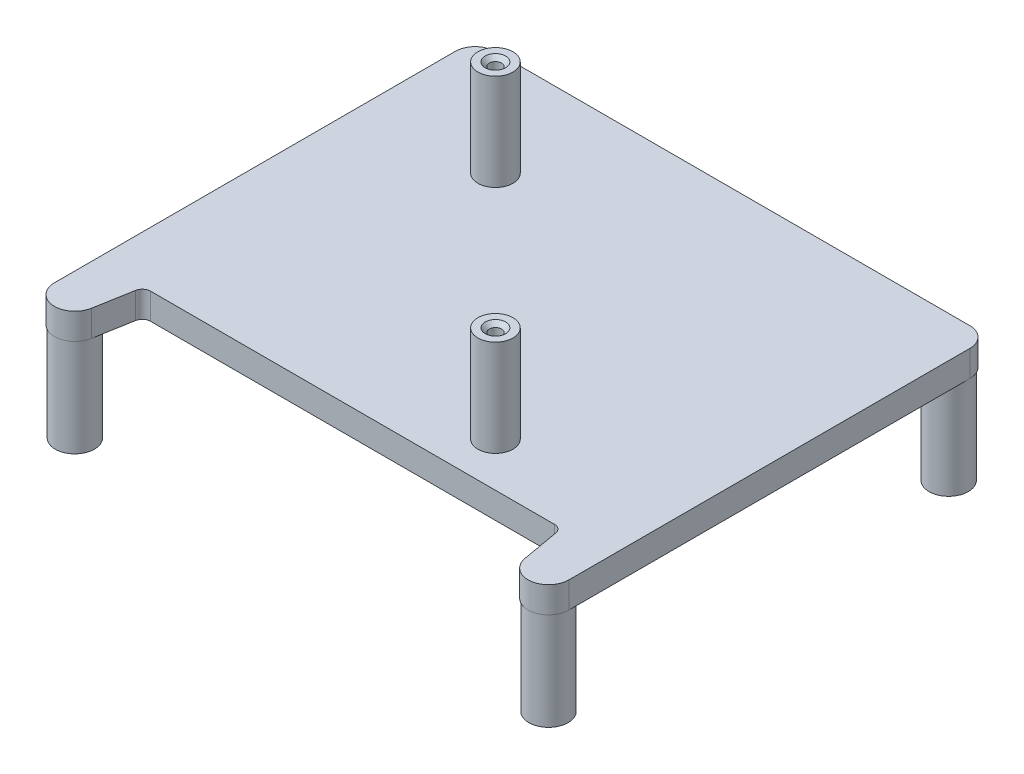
ISO-10303-21;
HEADER;
FILE_DESCRIPTION(('STEP AP214'),'2;1');
FILE_NAME('part.step','',(''),(''),'','','');
FILE_SCHEMA(('AUTOMOTIVE_DESIGN { 1 0 10303 214 1 1 1 1 }'));
ENDSEC;
DATA;
#1=APPLICATION_CONTEXT('core data for automotive mechanical design processes');
#2=APPLICATION_PROTOCOL_DEFINITION('international standard','automotive_design',2000,#1);
#3=PRODUCT_CONTEXT('',#1,'mechanical');
#4=PRODUCT('Part','Part','',(#3));
#5=PRODUCT_RELATED_PRODUCT_CATEGORY('part','',(#4));
#6=PRODUCT_DEFINITION_FORMATION('','',#4);
#7=PRODUCT_DEFINITION_CONTEXT('part definition',#1,'design');
#8=PRODUCT_DEFINITION('design','',#6,#7);
#9=PRODUCT_DEFINITION_SHAPE('','',#8);
#10=(LENGTH_UNIT() NAMED_UNIT(*) SI_UNIT(.MILLI.,.METRE.));
#11=(NAMED_UNIT(*) PLANE_ANGLE_UNIT() SI_UNIT($,.RADIAN.));
#12=(NAMED_UNIT(*) SI_UNIT($,.STERADIAN.) SOLID_ANGLE_UNIT());
#13=UNCERTAINTY_MEASURE_WITH_UNIT(LENGTH_MEASURE(1.E-05),#10,'distance_accuracy_value','');
#14=(GEOMETRIC_REPRESENTATION_CONTEXT(3) GLOBAL_UNCERTAINTY_ASSIGNED_CONTEXT((#13)) GLOBAL_UNIT_ASSIGNED_CONTEXT((#10,
#11,#12)) REPRESENTATION_CONTEXT('',''));
#15=CARTESIAN_POINT('',(0.,0.,0.));
#16=DIRECTION('',(0.,0.,1.));
#17=DIRECTION('',(1.,0.,0.));
#18=AXIS2_PLACEMENT_3D('',#15,#16,#17);
#19=CARTESIAN_POINT('',(-28.9987760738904,0.,24.4987760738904));
#20=DIRECTION('',(0.,-1.,0.));
#21=DIRECTION('',(0.,0.,-1.));
#22=AXIS2_PLACEMENT_3D('',#19,#20,#21);
#23=CYLINDRICAL_SURFACE('',#22,2.50122392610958);
#24=DIRECTION('',(0.,-1.,0.));
#25=VECTOR('',#24,1.);
#26=CARTESIAN_POINT('',(-31.5,3.2,24.4987760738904));
#27=LINE('',#26,#25);
#28=CARTESIAN_POINT('',(-31.5,0.,24.4987760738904));
#29=VERTEX_POINT('',#28);
#30=CARTESIAN_POINT('',(-31.5,3.2,24.4987760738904));
#31=VERTEX_POINT('',#30);
#32=EDGE_CURVE('E248',#29,#31,#27,.F.);
#33=ORIENTED_EDGE('',*,*,#32,.F.);
#34=CARTESIAN_POINT('',(-28.9987760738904,0.,24.4987760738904));
#35=DIRECTION('',(0.,1.,0.));
#36=DIRECTION('',(0.,0.,1.));
#37=AXIS2_PLACEMENT_3D('',#34,#35,#36);
#38=CIRCLE('',#37,2.50122392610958);
#39=CARTESIAN_POINT('',(-26.5355513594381,0.,24.9331090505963));
#40=VERTEX_POINT('',#39);
#41=EDGE_CURVE('E154',#40,#29,#38,.F.);
#42=ORIENTED_EDGE('',*,*,#41,.F.);
#43=DIRECTION('',(0.,1.,0.));
#44=VECTOR('',#43,1.);
#45=CARTESIAN_POINT('',(-26.5355513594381,0.,24.9331090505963));
#46=LINE('',#45,#44);
#47=CARTESIAN_POINT('',(-26.5355513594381,3.2,24.9331090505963));
#48=VERTEX_POINT('',#47);
#49=EDGE_CURVE('E250',#48,#40,#46,.F.);
#50=ORIENTED_EDGE('',*,*,#49,.F.);
#51=CARTESIAN_POINT('',(-28.9987760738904,3.2,24.4987760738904));
#52=DIRECTION('',(0.,1.,0.));
#53=DIRECTION('',(0.,0.,1.));
#54=AXIS2_PLACEMENT_3D('',#51,#52,#53);
#55=CIRCLE('',#54,2.50122392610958);
#56=EDGE_CURVE('E254',#31,#48,#55,.T.);
#57=ORIENTED_EDGE('',*,*,#56,.F.);
#58=EDGE_LOOP('',(#33,#42,#50,#57));
#59=FACE_BOUND('',#58,.T.);
#60=ADVANCED_FACE('F42',(#59),#23,.T.);
#61=CARTESIAN_POINT('',(28.9987760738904,3.2,24.4987760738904));
#62=DIRECTION('',(0.,-1.,0.));
#63=DIRECTION('',(0.,0.,-1.));
#64=AXIS2_PLACEMENT_3D('',#61,#62,#63);
#65=CYLINDRICAL_SURFACE('',#64,2.50122392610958);
#66=DIRECTION('',(0.,1.,0.));
#67=VECTOR('',#66,1.);
#68=CARTESIAN_POINT('',(31.5,3.2,24.4987760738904));
#69=LINE('',#68,#67);
#70=CARTESIAN_POINT('',(31.5,3.2,24.4987760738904));
#71=VERTEX_POINT('',#70);
#72=CARTESIAN_POINT('',(31.5,0.,24.4987760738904));
#73=VERTEX_POINT('',#72);
#74=EDGE_CURVE('E238',#71,#73,#69,.F.);
#75=ORIENTED_EDGE('',*,*,#74,.F.);
#76=CARTESIAN_POINT('',(28.9987760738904,3.2,24.4987760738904));
#77=DIRECTION('',(0.,1.,0.));
#78=DIRECTION('',(0.,0.,1.));
#79=AXIS2_PLACEMENT_3D('',#76,#77,#78);
#80=CIRCLE('',#79,2.50122392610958);
#81=CARTESIAN_POINT('',(26.5355513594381,3.2,24.9331090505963));
#82=VERTEX_POINT('',#81);
#83=EDGE_CURVE('E244',#82,#71,#80,.T.);
#84=ORIENTED_EDGE('',*,*,#83,.F.);
#85=DIRECTION('',(0.,-1.,0.));
#86=VECTOR('',#85,1.);
#87=CARTESIAN_POINT('',(26.5355513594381,3.2,24.9331090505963));
#88=LINE('',#87,#86);
#89=CARTESIAN_POINT('',(26.5355513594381,0.,24.9331090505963));
#90=VERTEX_POINT('',#89);
#91=EDGE_CURVE('E241',#90,#82,#88,.F.);
#92=ORIENTED_EDGE('',*,*,#91,.F.);
#93=CARTESIAN_POINT('',(28.9987760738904,0.,24.4987760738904));
#94=DIRECTION('',(0.,1.,0.));
#95=DIRECTION('',(0.,0.,1.));
#96=AXIS2_PLACEMENT_3D('',#93,#94,#95);
#97=CIRCLE('',#96,2.50122392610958);
#98=EDGE_CURVE('E246',#73,#90,#97,.F.);
#99=ORIENTED_EDGE('',*,*,#98,.F.);
#100=EDGE_LOOP('',(#75,#84,#92,#99));
#101=FACE_BOUND('',#100,.T.);
#102=ADVANCED_FACE('F291',(#101),#65,.T.);
#103=CARTESIAN_POINT('',(0.,3.2,19.5));
#104=DIRECTION('',(0.,0.,-1.));
#105=DIRECTION('',(-1.,0.,0.));
#106=AXIS2_PLACEMENT_3D('',#103,#104,#105);
#107=PLANE('',#106);
#108=DIRECTION('',(1.,0.,0.));
#109=VECTOR('',#108,1.);
#110=CARTESIAN_POINT('',(0.,0.,19.5));
#111=LINE('',#110,#109);
#112=CARTESIAN_POINT('',(-24.7384480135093,0.,19.5));
#113=VERTEX_POINT('',#112);
#114=CARTESIAN_POINT('',(24.7384480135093,0.,19.5));
#115=VERTEX_POINT('',#114);
#116=EDGE_CURVE('E270',#113,#115,#111,.T.);
#117=ORIENTED_EDGE('',*,*,#116,.T.);
#118=DIRECTION('',(0.,-1.,0.));
#119=VECTOR('',#118,1.);
#120=CARTESIAN_POINT('',(24.7384480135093,3.2,19.5));
#121=LINE('',#120,#119);
#122=CARTESIAN_POINT('',(24.7384480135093,3.2,19.5));
#123=VERTEX_POINT('',#122);
#124=EDGE_CURVE('E259',#115,#123,#121,.F.);
#125=ORIENTED_EDGE('',*,*,#124,.T.);
#126=DIRECTION('',(1.,0.,0.));
#127=VECTOR('',#126,1.);
#128=CARTESIAN_POINT('',(0.,3.2,19.5));
#129=LINE('',#128,#127);
#130=CARTESIAN_POINT('',(-24.7384480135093,3.2,19.5));
#131=VERTEX_POINT('',#130);
#132=EDGE_CURVE('E156',#131,#123,#129,.T.);
#133=ORIENTED_EDGE('',*,*,#132,.F.);
#134=DIRECTION('',(0.,-1.,0.));
#135=VECTOR('',#134,1.);
#136=CARTESIAN_POINT('',(-24.7384480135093,3.2,19.5));
#137=LINE('',#136,#135);
#138=EDGE_CURVE('E256',#131,#113,#137,.T.);
#139=ORIENTED_EDGE('',*,*,#138,.T.);
#140=EDGE_LOOP('',(#117,#125,#133,#139));
#141=FACE_BOUND('',#140,.T.);
#142=ADVANCED_FACE('F276',(#141),#107,.F.);
#143=CARTESIAN_POINT('',(31.5,3.2,0.));
#144=DIRECTION('',(1.,0.,0.));
#145=DIRECTION('',(0.,0.,-1.));
#146=AXIS2_PLACEMENT_3D('',#143,#144,#145);
#147=PLANE('',#146);
#148=DIRECTION('',(0.,0.,1.));
#149=VECTOR('',#148,1.);
#150=CARTESIAN_POINT('',(31.5,3.2,0.));
#151=LINE('',#150,#149);
#152=CARTESIAN_POINT('',(31.5,3.2,-24.6));
#153=VERTEX_POINT('',#152);
#154=EDGE_CURVE('E160',#153,#71,#151,.T.);
#155=ORIENTED_EDGE('',*,*,#154,.T.);
#156=ORIENTED_EDGE('',*,*,#74,.T.);
#157=DIRECTION('',(0.,0.,1.));
#158=VECTOR('',#157,1.);
#159=CARTESIAN_POINT('',(31.5,0.,0.));
#160=LINE('',#159,#158);
#161=CARTESIAN_POINT('',(31.5,0.,-24.6));
#162=VERTEX_POINT('',#161);
#163=EDGE_CURVE('E162',#162,#73,#160,.T.);
#164=ORIENTED_EDGE('',*,*,#163,.F.);
#165=DIRECTION('',(0.,-1.,0.));
#166=VECTOR('',#165,1.);
#167=CARTESIAN_POINT('',(31.5,3.2,-24.6));
#168=LINE('',#167,#166);
#169=EDGE_CURVE('E236',#162,#153,#168,.F.);
#170=ORIENTED_EDGE('',*,*,#169,.T.);
#171=EDGE_LOOP('',(#155,#156,#164,#170));
#172=FACE_BOUND('',#171,.T.);
#173=ADVANCED_FACE('F308',(#172),#147,.T.);
#174=CARTESIAN_POINT('',(0.,3.2,-27.));
#175=DIRECTION('',(0.,0.,-1.));
#176=DIRECTION('',(-1.,0.,0.));
#177=AXIS2_PLACEMENT_3D('',#174,#175,#176);
#178=PLANE('',#177);
#179=DIRECTION('',(1.,0.,0.));
#180=VECTOR('',#179,1.);
#181=CARTESIAN_POINT('',(0.,0.,-27.));
#182=LINE('',#181,#180);
#183=CARTESIAN_POINT('',(-29.1,0.,-27.));
#184=VERTEX_POINT('',#183);
#185=CARTESIAN_POINT('',(29.1,0.,-27.));
#186=VERTEX_POINT('',#185);
#187=EDGE_CURVE('E157',#184,#186,#182,.T.);
#188=ORIENTED_EDGE('',*,*,#187,.F.);
#189=DIRECTION('',(0.,-1.,0.));
#190=VECTOR('',#189,1.);
#191=CARTESIAN_POINT('',(-29.1,3.2,-27.));
#192=LINE('',#191,#190);
#193=CARTESIAN_POINT('',(-29.1,3.2,-27.));
#194=VERTEX_POINT('',#193);
#195=EDGE_CURVE('E135',#184,#194,#192,.F.);
#196=ORIENTED_EDGE('',*,*,#195,.T.);
#197=DIRECTION('',(1.,0.,0.));
#198=VECTOR('',#197,1.);
#199=CARTESIAN_POINT('',(0.,3.2,-27.));
#200=LINE('',#199,#198);
#201=CARTESIAN_POINT('',(29.1,3.2,-27.));
#202=VERTEX_POINT('',#201);
#203=EDGE_CURVE('E298',#194,#202,#200,.T.);
#204=ORIENTED_EDGE('',*,*,#203,.T.);
#205=DIRECTION('',(0.,-1.,0.));
#206=VECTOR('',#205,1.);
#207=CARTESIAN_POINT('',(29.1,3.2,-27.));
#208=LINE('',#207,#206);
#209=EDGE_CURVE('E139',#202,#186,#208,.T.);
#210=ORIENTED_EDGE('',*,*,#209,.T.);
#211=EDGE_LOOP('',(#188,#196,#204,#210));
#212=FACE_BOUND('',#211,.T.);
#213=ADVANCED_FACE('F305',(#212),#178,.T.);
#214=CARTESIAN_POINT('',(-31.5,3.2,0.));
#215=DIRECTION('',(1.,0.,0.));
#216=DIRECTION('',(0.,0.,-1.));
#217=AXIS2_PLACEMENT_3D('',#214,#215,#216);
#218=PLANE('',#217);
#219=DIRECTION('',(0.,0.,1.));
#220=VECTOR('',#219,1.);
#221=CARTESIAN_POINT('',(-31.5,0.,0.));
#222=LINE('',#221,#220);
#223=CARTESIAN_POINT('',(-31.5,0.,-24.6));
#224=VERTEX_POINT('',#223);
#225=EDGE_CURVE('E147',#224,#29,#222,.T.);
#226=ORIENTED_EDGE('',*,*,#225,.T.);
#227=ORIENTED_EDGE('',*,*,#32,.T.);
#228=DIRECTION('',(0.,0.,1.));
#229=VECTOR('',#228,1.);
#230=CARTESIAN_POINT('',(-31.5,3.2,0.));
#231=LINE('',#230,#229);
#232=CARTESIAN_POINT('',(-31.5,3.2,-24.6));
#233=VERTEX_POINT('',#232);
#234=EDGE_CURVE('E149',#233,#31,#231,.T.);
#235=ORIENTED_EDGE('',*,*,#234,.F.);
#236=DIRECTION('',(0.,-1.,0.));
#237=VECTOR('',#236,1.);
#238=CARTESIAN_POINT('',(-31.5,0.,-24.6));
#239=LINE('',#238,#237);
#240=EDGE_CURVE('E134',#233,#224,#239,.T.);
#241=ORIENTED_EDGE('',*,*,#240,.T.);
#242=EDGE_LOOP('',(#226,#227,#235,#241));
#243=FACE_BOUND('',#242,.T.);
#244=ADVANCED_FACE('F145',(#243),#218,.F.);
#245=CARTESIAN_POINT('',(0.,3.2,0.));
#246=DIRECTION('',(0.,1.,0.));
#247=DIRECTION('',(0.,0.,1.));
#248=AXIS2_PLACEMENT_3D('',#245,#246,#247);
#249=PLANE('',#248);
#250=CARTESIAN_POINT('',(12.075,3.2,14.075));
#251=DIRECTION('',(0.,1.,0.));
#252=DIRECTION('',(0.,0.,1.));
#253=AXIS2_PLACEMENT_3D('',#250,#251,#252);
#254=CIRCLE('',#253,2.15);
#255=CARTESIAN_POINT('',(12.075,3.2,16.225));
#256=VERTEX_POINT('',#255);
#257=EDGE_CURVE('E342',#256,#256,#254,.T.);
#258=ORIENTED_EDGE('',*,*,#257,.F.);
#259=EDGE_LOOP('',(#258));
#260=FACE_BOUND('',#259,.T.);
#261=CARTESIAN_POINT('',(-16.125,3.2,-14.125));
#262=DIRECTION('',(0.,1.,0.));
#263=DIRECTION('',(0.,0.,1.));
#264=AXIS2_PLACEMENT_3D('',#261,#262,#263);
#265=CIRCLE('',#264,2.15);
#266=CARTESIAN_POINT('',(-16.125,3.2,-11.975));
#267=VERTEX_POINT('',#266);
#268=EDGE_CURVE('E336',#267,#267,#265,.T.);
#269=ORIENTED_EDGE('',*,*,#268,.F.);
#270=EDGE_LOOP('',(#269));
#271=FACE_BOUND('',#270,.T.);
#272=ORIENTED_EDGE('',*,*,#234,.T.);
#273=ORIENTED_EDGE('',*,*,#56,.T.);
#274=DIRECTION('',(0.173648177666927,0.,-0.984807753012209));
#275=VECTOR('',#274,1.);
#276=CARTESIAN_POINT('',(-21.4715938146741,3.2,-3.78602130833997));
#277=LINE('',#276,#275);
#278=CARTESIAN_POINT('',(-25.7232557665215,3.2,20.3263518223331));
#279=VERTEX_POINT('',#278);
#280=EDGE_CURVE('E225',#48,#279,#277,.T.);
#281=ORIENTED_EDGE('',*,*,#280,.T.);
#282=CARTESIAN_POINT('',(-24.7384480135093,3.2,20.5));
#283=DIRECTION('',(0.,1.,0.));
#284=DIRECTION('',(0.,0.,1.));
#285=AXIS2_PLACEMENT_3D('',#282,#283,#284);
#286=CIRCLE('',#285,1.);
#287=EDGE_CURVE('E12',#279,#131,#286,.F.);
#288=ORIENTED_EDGE('',*,*,#287,.T.);
#289=ORIENTED_EDGE('',*,*,#132,.T.);
#290=CARTESIAN_POINT('',(24.7384480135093,3.2,20.5));
#291=DIRECTION('',(0.,1.,0.));
#292=DIRECTION('',(0.,0.,1.));
#293=AXIS2_PLACEMENT_3D('',#290,#291,#292);
#294=CIRCLE('',#293,1.);
#295=CARTESIAN_POINT('',(25.7232557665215,3.2,20.3263518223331));
#296=VERTEX_POINT('',#295);
#297=EDGE_CURVE('E265',#123,#296,#294,.F.);
#298=ORIENTED_EDGE('',*,*,#297,.T.);
#299=DIRECTION('',(-0.173648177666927,0.,-0.984807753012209));
#300=VECTOR('',#299,1.);
#301=CARTESIAN_POINT('',(21.4715938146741,3.2,-3.78602130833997));
#302=LINE('',#301,#300);
#303=EDGE_CURVE('E150',#296,#82,#302,.F.);
#304=ORIENTED_EDGE('',*,*,#303,.T.);
#305=ORIENTED_EDGE('',*,*,#83,.T.);
#306=ORIENTED_EDGE('',*,*,#154,.F.);
#307=CARTESIAN_POINT('',(29.1,3.2,-24.6));
#308=DIRECTION('',(0.,1.,0.));
#309=DIRECTION('',(0.,0.,1.));
#310=AXIS2_PLACEMENT_3D('',#307,#308,#309);
#311=CIRCLE('',#310,2.4);
#312=EDGE_CURVE('E232',#153,#202,#311,.T.);
#313=ORIENTED_EDGE('',*,*,#312,.T.);
#314=ORIENTED_EDGE('',*,*,#203,.F.);
#315=CARTESIAN_POINT('',(-29.1,3.2,-24.6));
#316=DIRECTION('',(0.,1.,0.));
#317=DIRECTION('',(0.,0.,1.));
#318=AXIS2_PLACEMENT_3D('',#315,#316,#317);
#319=CIRCLE('',#318,2.4);
#320=EDGE_CURVE('E234',#194,#233,#319,.T.);
#321=ORIENTED_EDGE('',*,*,#320,.T.);
#322=EDGE_LOOP('',(#272,#273,#281,#288,#289,#298,#304,#305,#306,#313,#314,#321));
#323=FACE_BOUND('',#322,.T.);
#324=ADVANCED_FACE('F284',(#260,#271,#323),#249,.T.);
#325=CARTESIAN_POINT('',(0.,0.,0.));
#326=DIRECTION('',(0.,1.,0.));
#327=DIRECTION('',(0.,0.,1.));
#328=AXIS2_PLACEMENT_3D('',#325,#326,#327);
#329=PLANE('',#328);
#330=CARTESIAN_POINT('',(-29.,0.,24.5));
#331=DIRECTION('',(0.,1.,0.));
#332=DIRECTION('',(0.,0.,1.));
#333=AXIS2_PLACEMENT_3D('',#330,#331,#332);
#334=CIRCLE('',#333,2.4);
#335=CARTESIAN_POINT('',(-29.,0.,26.9));
#336=VERTEX_POINT('',#335);
#337=EDGE_CURVE('E175',#336,#336,#334,.F.);
#338=ORIENTED_EDGE('',*,*,#337,.F.);
#339=EDGE_LOOP('',(#338));
#340=FACE_BOUND('',#339,.T.);
#341=CARTESIAN_POINT('',(29.,0.,24.5));
#342=DIRECTION('',(0.,1.,0.));
#343=DIRECTION('',(0.,0.,1.));
#344=AXIS2_PLACEMENT_3D('',#341,#342,#343);
#345=CIRCLE('',#344,2.4);
#346=CARTESIAN_POINT('',(29.,0.,26.9));
#347=VERTEX_POINT('',#346);
#348=EDGE_CURVE('E172',#347,#347,#345,.F.);
#349=ORIENTED_EDGE('',*,*,#348,.F.);
#350=EDGE_LOOP('',(#349));
#351=FACE_BOUND('',#350,.T.);
#352=CARTESIAN_POINT('',(29.,0.,-24.5));
#353=DIRECTION('',(0.,1.,0.));
#354=DIRECTION('',(0.,0.,1.));
#355=AXIS2_PLACEMENT_3D('',#352,#353,#354);
#356=CIRCLE('',#355,2.4);
#357=CARTESIAN_POINT('',(29.,0.,-22.1));
#358=VERTEX_POINT('',#357);
#359=EDGE_CURVE('E169',#358,#358,#356,.F.);
#360=ORIENTED_EDGE('',*,*,#359,.F.);
#361=EDGE_LOOP('',(#360));
#362=FACE_BOUND('',#361,.T.);
#363=CARTESIAN_POINT('',(-29.,0.,-24.5));
#364=DIRECTION('',(0.,1.,0.));
#365=DIRECTION('',(0.,0.,1.));
#366=AXIS2_PLACEMENT_3D('',#363,#364,#365);
#367=CIRCLE('',#366,2.4);
#368=CARTESIAN_POINT('',(-29.,0.,-22.1));
#369=VERTEX_POINT('',#368);
#370=EDGE_CURVE('E166',#369,#369,#367,.F.);
#371=ORIENTED_EDGE('',*,*,#370,.F.);
#372=EDGE_LOOP('',(#371));
#373=FACE_BOUND('',#372,.T.);
#374=ORIENTED_EDGE('',*,*,#116,.F.);
#375=CARTESIAN_POINT('',(-24.7384480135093,0.,20.5));
#376=DIRECTION('',(0.,1.,0.));
#377=DIRECTION('',(0.,0.,1.));
#378=AXIS2_PLACEMENT_3D('',#375,#376,#377);
#379=CIRCLE('',#378,1.);
#380=CARTESIAN_POINT('',(-25.7232557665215,0.,20.3263518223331));
#381=VERTEX_POINT('',#380);
#382=EDGE_CURVE('E50',#113,#381,#379,.T.);
#383=ORIENTED_EDGE('',*,*,#382,.T.);
#384=DIRECTION('',(-0.173648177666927,0.,0.984807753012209));
#385=VECTOR('',#384,1.);
#386=CARTESIAN_POINT('',(-25.,0.,16.2245645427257));
#387=LINE('',#386,#385);
#388=EDGE_CURVE('E220',#381,#40,#387,.T.);
#389=ORIENTED_EDGE('',*,*,#388,.T.);
#390=ORIENTED_EDGE('',*,*,#41,.T.);
#391=ORIENTED_EDGE('',*,*,#225,.F.);
#392=CARTESIAN_POINT('',(-29.1,0.,-24.6));
#393=DIRECTION('',(0.,1.,0.));
#394=DIRECTION('',(0.,0.,1.));
#395=AXIS2_PLACEMENT_3D('',#392,#393,#394);
#396=CIRCLE('',#395,2.4);
#397=EDGE_CURVE('E130',#224,#184,#396,.F.);
#398=ORIENTED_EDGE('',*,*,#397,.T.);
#399=ORIENTED_EDGE('',*,*,#187,.T.);
#400=CARTESIAN_POINT('',(29.1,0.,-24.6));
#401=DIRECTION('',(0.,1.,0.));
#402=DIRECTION('',(0.,0.,1.));
#403=AXIS2_PLACEMENT_3D('',#400,#401,#402);
#404=CIRCLE('',#403,2.4);
#405=EDGE_CURVE('E140',#186,#162,#404,.F.);
#406=ORIENTED_EDGE('',*,*,#405,.T.);
#407=ORIENTED_EDGE('',*,*,#163,.T.);
#408=ORIENTED_EDGE('',*,*,#98,.T.);
#409=DIRECTION('',(0.173648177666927,0.,0.984807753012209));
#410=VECTOR('',#409,1.);
#411=CARTESIAN_POINT('',(26.9000000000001,0.,27.));
#412=LINE('',#411,#410);
#413=CARTESIAN_POINT('',(25.7232557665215,0.,20.3263518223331));
#414=VERTEX_POINT('',#413);
#415=EDGE_CURVE('E222',#90,#414,#412,.F.);
#416=ORIENTED_EDGE('',*,*,#415,.T.);
#417=CARTESIAN_POINT('',(24.7384480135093,0.,20.5));
#418=DIRECTION('',(0.,1.,0.));
#419=DIRECTION('',(0.,0.,1.));
#420=AXIS2_PLACEMENT_3D('',#417,#418,#419);
#421=CIRCLE('',#420,1.);
#422=EDGE_CURVE('E267',#414,#115,#421,.T.);
#423=ORIENTED_EDGE('',*,*,#422,.T.);
#424=EDGE_LOOP('',(#374,#383,#389,#390,#391,#398,#399,#406,#407,#408,#416,#423));
#425=FACE_BOUND('',#424,.T.);
#426=ADVANCED_FACE('F152',(#340,#351,#362,#373,#425),#329,.F.);
#427=CARTESIAN_POINT('',(-29.,-12.,-24.5));
#428=DIRECTION('',(0.,-1.,0.));
#429=DIRECTION('',(0.,0.,-1.));
#430=AXIS2_PLACEMENT_3D('',#427,#428,#429);
#431=PLANE('',#430);
#432=CARTESIAN_POINT('',(-29.,-12.,-24.5));
#433=DIRECTION('',(0.,-1.,0.));
#434=DIRECTION('',(0.,0.,-1.));
#435=AXIS2_PLACEMENT_3D('',#432,#433,#434);
#436=CIRCLE('',#435,1.25000000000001);
#437=CARTESIAN_POINT('',(-29.,-12.,-25.75));
#438=VERTEX_POINT('',#437);
#439=EDGE_CURVE('E205',#438,#438,#436,.F.);
#440=ORIENTED_EDGE('',*,*,#439,.T.);
#441=EDGE_LOOP('',(#440));
#442=FACE_BOUND('',#441,.T.);
#443=CARTESIAN_POINT('',(-29.,-12.,-24.5));
#444=DIRECTION('',(0.,-1.,0.));
#445=DIRECTION('',(0.,0.,-1.));
#446=AXIS2_PLACEMENT_3D('',#443,#444,#445);
#447=CIRCLE('',#446,2.4);
#448=CARTESIAN_POINT('',(-29.,-12.,-26.9));
#449=VERTEX_POINT('',#448);
#450=EDGE_CURVE('E279',#449,#449,#447,.T.);
#451=ORIENTED_EDGE('',*,*,#450,.T.);
#452=EDGE_LOOP('',(#451));
#453=FACE_BOUND('',#452,.T.);
#454=ADVANCED_FACE('F466',(#442,#453),#431,.T.);
#455=CARTESIAN_POINT('',(-29.,-12.,-24.5));
#456=DIRECTION('',(0.,1.,0.));
#457=DIRECTION('',(0.,0.,1.));
#458=AXIS2_PLACEMENT_3D('',#455,#456,#457);
#459=CYLINDRICAL_SURFACE('',#458,2.4);
#460=ORIENTED_EDGE('',*,*,#450,.F.);
#461=EDGE_LOOP('',(#460));
#462=FACE_BOUND('',#461,.T.);
#463=ORIENTED_EDGE('',*,*,#370,.T.);
#464=EDGE_LOOP('',(#463));
#465=FACE_BOUND('',#464,.T.);
#466=ADVANCED_FACE('F470',(#462,#465),#459,.T.);
#467=CARTESIAN_POINT('',(-29.,-12.,-24.5));
#468=DIRECTION('',(0.,1.,0.));
#469=DIRECTION('',(0.,0.,1.));
#470=AXIS2_PLACEMENT_3D('',#467,#468,#469);
#471=CYLINDRICAL_SURFACE('',#470,0.750000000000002);
#472=CARTESIAN_POINT('',(-29.,-11.5,-24.5));
#473=DIRECTION('',(0.,-1.,0.));
#474=DIRECTION('',(0.,0.,-1.));
#475=AXIS2_PLACEMENT_3D('',#472,#473,#474);
#476=CIRCLE('',#475,0.750000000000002);
#477=CARTESIAN_POINT('',(-29.,-11.5,-25.25));
#478=VERTEX_POINT('',#477);
#479=EDGE_CURVE('E202',#478,#478,#476,.T.);
#480=ORIENTED_EDGE('',*,*,#479,.T.);
#481=EDGE_LOOP('',(#480));
#482=FACE_BOUND('',#481,.T.);
#483=CARTESIAN_POINT('',(-29.,0.,-24.5));
#484=DIRECTION('',(0.,-1.,0.));
#485=DIRECTION('',(0.,0.,-1.));
#486=AXIS2_PLACEMENT_3D('',#483,#484,#485);
#487=CIRCLE('',#486,0.750000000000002);
#488=CARTESIAN_POINT('',(-29.,0.,-25.25));
#489=VERTEX_POINT('',#488);
#490=EDGE_CURVE('E314',#489,#489,#487,.T.);
#491=ORIENTED_EDGE('',*,*,#490,.F.);
#492=EDGE_LOOP('',(#491));
#493=FACE_BOUND('',#492,.T.);
#494=ADVANCED_FACE('F473',(#482,#493),#471,.F.);
#495=ORIENTED_EDGE('',*,*,#490,.T.);
#496=EDGE_LOOP('',(#495));
#497=FACE_BOUND('',#496,.T.);
#498=ADVANCED_FACE('F468',(#497),#329,.F.);
#499=CARTESIAN_POINT('',(29.,-12.,-24.5));
#500=DIRECTION('',(0.,1.,0.));
#501=DIRECTION('',(0.,0.,1.));
#502=AXIS2_PLACEMENT_3D('',#499,#500,#501);
#503=PLANE('',#502);
#504=CARTESIAN_POINT('',(29.,-12.,-24.5));
#505=DIRECTION('',(0.,1.,0.));
#506=DIRECTION('',(0.,0.,1.));
#507=AXIS2_PLACEMENT_3D('',#504,#505,#506);
#508=CIRCLE('',#507,1.25000000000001);
#509=CARTESIAN_POINT('',(29.,-12.,-23.25));
#510=VERTEX_POINT('',#509);
#511=EDGE_CURVE('E199',#510,#510,#508,.T.);
#512=ORIENTED_EDGE('',*,*,#511,.T.);
#513=EDGE_LOOP('',(#512));
#514=FACE_BOUND('',#513,.T.);
#515=CARTESIAN_POINT('',(29.,-12.,-24.5));
#516=DIRECTION('',(0.,-1.,0.));
#517=DIRECTION('',(0.,0.,1.));
#518=AXIS2_PLACEMENT_3D('',#515,#516,#517);
#519=CIRCLE('',#518,2.4);
#520=CARTESIAN_POINT('',(29.,-12.,-22.1));
#521=VERTEX_POINT('',#520);
#522=EDGE_CURVE('E317',#521,#521,#519,.T.);
#523=ORIENTED_EDGE('',*,*,#522,.T.);
#524=EDGE_LOOP('',(#523));
#525=FACE_BOUND('',#524,.T.);
#526=ADVANCED_FACE('F485',(#514,#525),#503,.F.);
#527=CARTESIAN_POINT('',(29.,-12.,-24.5));
#528=DIRECTION('',(0.,1.,0.));
#529=DIRECTION('',(0.,0.,1.));
#530=AXIS2_PLACEMENT_3D('',#527,#528,#529);
#531=CYLINDRICAL_SURFACE('',#530,2.4);
#532=ORIENTED_EDGE('',*,*,#522,.F.);
#533=EDGE_LOOP('',(#532));
#534=FACE_BOUND('',#533,.T.);
#535=ORIENTED_EDGE('',*,*,#359,.T.);
#536=EDGE_LOOP('',(#535));
#537=FACE_BOUND('',#536,.T.);
#538=ADVANCED_FACE('F481',(#534,#537),#531,.T.);
#539=CARTESIAN_POINT('',(29.,-12.,-24.5));
#540=DIRECTION('',(0.,1.,0.));
#541=DIRECTION('',(0.,0.,1.));
#542=AXIS2_PLACEMENT_3D('',#539,#540,#541);
#543=CYLINDRICAL_SURFACE('',#542,0.750000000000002);
#544=CARTESIAN_POINT('',(29.,-11.5,-24.5));
#545=DIRECTION('',(0.,1.,0.));
#546=DIRECTION('',(0.,0.,1.));
#547=AXIS2_PLACEMENT_3D('',#544,#545,#546);
#548=CIRCLE('',#547,0.750000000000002);
#549=CARTESIAN_POINT('',(29.,-11.5,-23.75));
#550=VERTEX_POINT('',#549);
#551=EDGE_CURVE('E196',#550,#550,#548,.F.);
#552=ORIENTED_EDGE('',*,*,#551,.T.);
#553=EDGE_LOOP('',(#552));
#554=FACE_BOUND('',#553,.T.);
#555=CARTESIAN_POINT('',(29.,0.,-24.5));
#556=DIRECTION('',(0.,-1.,0.));
#557=DIRECTION('',(0.,0.,1.));
#558=AXIS2_PLACEMENT_3D('',#555,#556,#557);
#559=CIRCLE('',#558,0.750000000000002);
#560=CARTESIAN_POINT('',(29.,0.,-23.75));
#561=VERTEX_POINT('',#560);
#562=EDGE_CURVE('E320',#561,#561,#559,.T.);
#563=ORIENTED_EDGE('',*,*,#562,.F.);
#564=EDGE_LOOP('',(#563));
#565=FACE_BOUND('',#564,.T.);
#566=ADVANCED_FACE('F484',(#554,#565),#543,.F.);
#567=ORIENTED_EDGE('',*,*,#562,.T.);
#568=EDGE_LOOP('',(#567));
#569=FACE_BOUND('',#568,.T.);
#570=ADVANCED_FACE('F492',(#569),#329,.F.);
#571=CARTESIAN_POINT('',(29.,-12.,24.5));
#572=DIRECTION('',(0.,-1.,0.));
#573=DIRECTION('',(0.,0.,-1.));
#574=AXIS2_PLACEMENT_3D('',#571,#572,#573);
#575=PLANE('',#574);
#576=CARTESIAN_POINT('',(29.,-12.,24.5));
#577=DIRECTION('',(0.,-1.,0.));
#578=DIRECTION('',(0.,0.,-1.));
#579=AXIS2_PLACEMENT_3D('',#576,#577,#578);
#580=CIRCLE('',#579,1.25000000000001);
#581=CARTESIAN_POINT('',(29.,-12.,23.25));
#582=VERTEX_POINT('',#581);
#583=EDGE_CURVE('E193',#582,#582,#580,.F.);
#584=ORIENTED_EDGE('',*,*,#583,.T.);
#585=EDGE_LOOP('',(#584));
#586=FACE_BOUND('',#585,.T.);
#587=CARTESIAN_POINT('',(29.,-12.,24.5));
#588=DIRECTION('',(0.,-1.,0.));
#589=DIRECTION('',(0.,0.,-1.));
#590=AXIS2_PLACEMENT_3D('',#587,#588,#589);
#591=CIRCLE('',#590,2.4);
#592=CARTESIAN_POINT('',(29.,-12.,22.1));
#593=VERTEX_POINT('',#592);
#594=EDGE_CURVE('E323',#593,#593,#591,.T.);
#595=ORIENTED_EDGE('',*,*,#594,.T.);
#596=EDGE_LOOP('',(#595));
#597=FACE_BOUND('',#596,.T.);
#598=ADVANCED_FACE('F498',(#586,#597),#575,.T.);
#599=CARTESIAN_POINT('',(29.,-12.,24.5));
#600=DIRECTION('',(0.,1.,0.));
#601=DIRECTION('',(0.,0.,1.));
#602=AXIS2_PLACEMENT_3D('',#599,#600,#601);
#603=CYLINDRICAL_SURFACE('',#602,2.4);
#604=ORIENTED_EDGE('',*,*,#594,.F.);
#605=EDGE_LOOP('',(#604));
#606=FACE_BOUND('',#605,.T.);
#607=ORIENTED_EDGE('',*,*,#348,.T.);
#608=EDGE_LOOP('',(#607));
#609=FACE_BOUND('',#608,.T.);
#610=ADVANCED_FACE('F494',(#606,#609),#603,.T.);
#611=CARTESIAN_POINT('',(29.,-12.,24.5));
#612=DIRECTION('',(0.,1.,0.));
#613=DIRECTION('',(0.,0.,1.));
#614=AXIS2_PLACEMENT_3D('',#611,#612,#613);
#615=CYLINDRICAL_SURFACE('',#614,0.750000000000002);
#616=CARTESIAN_POINT('',(29.,-11.5,24.5));
#617=DIRECTION('',(0.,-1.,0.));
#618=DIRECTION('',(0.,0.,-1.));
#619=AXIS2_PLACEMENT_3D('',#616,#617,#618);
#620=CIRCLE('',#619,0.750000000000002);
#621=CARTESIAN_POINT('',(29.,-11.5,23.75));
#622=VERTEX_POINT('',#621);
#623=EDGE_CURVE('E190',#622,#622,#620,.T.);
#624=ORIENTED_EDGE('',*,*,#623,.T.);
#625=EDGE_LOOP('',(#624));
#626=FACE_BOUND('',#625,.T.);
#627=CARTESIAN_POINT('',(29.,0.,24.5));
#628=DIRECTION('',(0.,-1.,0.));
#629=DIRECTION('',(0.,0.,-1.));
#630=AXIS2_PLACEMENT_3D('',#627,#628,#629);
#631=CIRCLE('',#630,0.750000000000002);
#632=CARTESIAN_POINT('',(29.,0.,23.75));
#633=VERTEX_POINT('',#632);
#634=EDGE_CURVE('E326',#633,#633,#631,.T.);
#635=ORIENTED_EDGE('',*,*,#634,.F.);
#636=EDGE_LOOP('',(#635));
#637=FACE_BOUND('',#636,.T.);
#638=ADVANCED_FACE('F497',(#626,#637),#615,.F.);
#639=ORIENTED_EDGE('',*,*,#634,.T.);
#640=EDGE_LOOP('',(#639));
#641=FACE_BOUND('',#640,.T.);
#642=ADVANCED_FACE('F505',(#641),#329,.F.);
#643=CARTESIAN_POINT('',(-29.,-12.,24.5));
#644=DIRECTION('',(0.,1.,0.));
#645=DIRECTION('',(0.,0.,1.));
#646=AXIS2_PLACEMENT_3D('',#643,#644,#645);
#647=PLANE('',#646);
#648=CARTESIAN_POINT('',(-29.,-12.,24.5));
#649=DIRECTION('',(0.,1.,0.));
#650=DIRECTION('',(0.,0.,1.));
#651=AXIS2_PLACEMENT_3D('',#648,#649,#650);
#652=CIRCLE('',#651,1.25000000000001);
#653=CARTESIAN_POINT('',(-29.,-12.,25.75));
#654=VERTEX_POINT('',#653);
#655=EDGE_CURVE('E187',#654,#654,#652,.T.);
#656=ORIENTED_EDGE('',*,*,#655,.T.);
#657=EDGE_LOOP('',(#656));
#658=FACE_BOUND('',#657,.T.);
#659=CARTESIAN_POINT('',(-29.,-12.,24.5));
#660=DIRECTION('',(0.,-1.,0.));
#661=DIRECTION('',(0.,0.,1.));
#662=AXIS2_PLACEMENT_3D('',#659,#660,#661);
#663=CIRCLE('',#662,2.4);
#664=CARTESIAN_POINT('',(-29.,-12.,26.9));
#665=VERTEX_POINT('',#664);
#666=EDGE_CURVE('E329',#665,#665,#663,.T.);
#667=ORIENTED_EDGE('',*,*,#666,.T.);
#668=EDGE_LOOP('',(#667));
#669=FACE_BOUND('',#668,.T.);
#670=ADVANCED_FACE('F511',(#658,#669),#647,.F.);
#671=CARTESIAN_POINT('',(-29.,-12.,24.5));
#672=DIRECTION('',(0.,1.,0.));
#673=DIRECTION('',(0.,0.,1.));
#674=AXIS2_PLACEMENT_3D('',#671,#672,#673);
#675=CYLINDRICAL_SURFACE('',#674,2.4);
#676=ORIENTED_EDGE('',*,*,#666,.F.);
#677=EDGE_LOOP('',(#676));
#678=FACE_BOUND('',#677,.T.);
#679=ORIENTED_EDGE('',*,*,#337,.T.);
#680=EDGE_LOOP('',(#679));
#681=FACE_BOUND('',#680,.T.);
#682=ADVANCED_FACE('F507',(#678,#681),#675,.T.);
#683=CARTESIAN_POINT('',(-29.,-12.,24.5));
#684=DIRECTION('',(0.,1.,0.));
#685=DIRECTION('',(0.,0.,1.));
#686=AXIS2_PLACEMENT_3D('',#683,#684,#685);
#687=CYLINDRICAL_SURFACE('',#686,0.750000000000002);
#688=CARTESIAN_POINT('',(-29.,-11.5,24.5));
#689=DIRECTION('',(0.,1.,0.));
#690=DIRECTION('',(0.,0.,1.));
#691=AXIS2_PLACEMENT_3D('',#688,#689,#690);
#692=CIRCLE('',#691,0.750000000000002);
#693=CARTESIAN_POINT('',(-29.,-11.5,25.25));
#694=VERTEX_POINT('',#693);
#695=EDGE_CURVE('E184',#694,#694,#692,.F.);
#696=ORIENTED_EDGE('',*,*,#695,.T.);
#697=EDGE_LOOP('',(#696));
#698=FACE_BOUND('',#697,.T.);
#699=CARTESIAN_POINT('',(-29.,0.,24.5));
#700=DIRECTION('',(0.,-1.,0.));
#701=DIRECTION('',(0.,0.,1.));
#702=AXIS2_PLACEMENT_3D('',#699,#700,#701);
#703=CIRCLE('',#702,0.750000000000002);
#704=CARTESIAN_POINT('',(-29.,0.,25.25));
#705=VERTEX_POINT('',#704);
#706=EDGE_CURVE('E332',#705,#705,#703,.T.);
#707=ORIENTED_EDGE('',*,*,#706,.F.);
#708=EDGE_LOOP('',(#707));
#709=FACE_BOUND('',#708,.T.);
#710=ADVANCED_FACE('F510',(#698,#709),#687,.F.);
#711=ORIENTED_EDGE('',*,*,#706,.T.);
#712=EDGE_LOOP('',(#711));
#713=FACE_BOUND('',#712,.T.);
#714=ADVANCED_FACE('F376',(#713),#329,.F.);
#715=CARTESIAN_POINT('',(-16.125,15.,-14.125));
#716=DIRECTION('',(0.,1.,0.));
#717=DIRECTION('',(0.,0.,1.));
#718=AXIS2_PLACEMENT_3D('',#715,#716,#717);
#719=PLANE('',#718);
#720=CARTESIAN_POINT('',(-16.125,15.,-14.125));
#721=DIRECTION('',(0.,1.,0.));
#722=DIRECTION('',(0.,0.,1.));
#723=AXIS2_PLACEMENT_3D('',#720,#721,#722);
#724=CIRCLE('',#723,1.25000000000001);
#725=CARTESIAN_POINT('',(-16.125,15.,-12.875));
#726=VERTEX_POINT('',#725);
#727=EDGE_CURVE('E211',#726,#726,#724,.F.);
#728=ORIENTED_EDGE('',*,*,#727,.T.);
#729=EDGE_LOOP('',(#728));
#730=FACE_BOUND('',#729,.T.);
#731=CARTESIAN_POINT('',(-16.125,15.,-14.125));
#732=DIRECTION('',(0.,1.,0.));
#733=DIRECTION('',(0.,0.,1.));
#734=AXIS2_PLACEMENT_3D('',#731,#732,#733);
#735=CIRCLE('',#734,2.15);
#736=CARTESIAN_POINT('',(-16.125,15.,-11.975));
#737=VERTEX_POINT('',#736);
#738=EDGE_CURVE('E335',#737,#737,#735,.T.);
#739=ORIENTED_EDGE('',*,*,#738,.T.);
#740=EDGE_LOOP('',(#739));
#741=FACE_BOUND('',#740,.T.);
#742=ADVANCED_FACE('F367',(#730,#741),#719,.T.);
#743=CARTESIAN_POINT('',(-16.125,15.,-14.125));
#744=DIRECTION('',(0.,-1.,0.));
#745=DIRECTION('',(0.,0.,-1.));
#746=AXIS2_PLACEMENT_3D('',#743,#744,#745);
#747=CYLINDRICAL_SURFACE('',#746,2.15);
#748=ORIENTED_EDGE('',*,*,#738,.F.);
#749=EDGE_LOOP('',(#748));
#750=FACE_BOUND('',#749,.T.);
#751=ORIENTED_EDGE('',*,*,#268,.T.);
#752=EDGE_LOOP('',(#751));
#753=FACE_BOUND('',#752,.T.);
#754=ADVANCED_FACE('F364',(#750,#753),#747,.T.);
#755=CARTESIAN_POINT('',(-16.125,15.,-14.125));
#756=DIRECTION('',(0.,-1.,0.));
#757=DIRECTION('',(0.,0.,-1.));
#758=AXIS2_PLACEMENT_3D('',#755,#756,#757);
#759=CYLINDRICAL_SURFACE('',#758,0.75);
#760=CARTESIAN_POINT('',(-16.125,14.5,-14.125));
#761=DIRECTION('',(0.,1.,0.));
#762=DIRECTION('',(0.,0.,1.));
#763=AXIS2_PLACEMENT_3D('',#760,#761,#762);
#764=CIRCLE('',#763,0.75);
#765=CARTESIAN_POINT('',(-16.125,14.5,-13.375));
#766=VERTEX_POINT('',#765);
#767=EDGE_CURVE('E208',#766,#766,#764,.T.);
#768=ORIENTED_EDGE('',*,*,#767,.T.);
#769=EDGE_LOOP('',(#768));
#770=FACE_BOUND('',#769,.T.);
#771=CARTESIAN_POINT('',(-16.125,3.2,-14.125));
#772=DIRECTION('',(0.,1.,0.));
#773=DIRECTION('',(0.,0.,1.));
#774=AXIS2_PLACEMENT_3D('',#771,#772,#773);
#775=CIRCLE('',#774,0.75);
#776=CARTESIAN_POINT('',(-16.125,3.2,-13.375));
#777=VERTEX_POINT('',#776);
#778=EDGE_CURVE('E178',#777,#777,#775,.F.);
#779=ORIENTED_EDGE('',*,*,#778,.T.);
#780=EDGE_LOOP('',(#779));
#781=FACE_BOUND('',#780,.T.);
#782=ADVANCED_FACE('F366',(#770,#781),#759,.F.);
#783=ORIENTED_EDGE('',*,*,#778,.F.);
#784=EDGE_LOOP('',(#783));
#785=FACE_BOUND('',#784,.T.);
#786=ADVANCED_FACE('F361',(#785),#249,.T.);
#787=CARTESIAN_POINT('',(12.075,15.,14.075));
#788=DIRECTION('',(0.,1.,0.));
#789=DIRECTION('',(0.,0.,1.));
#790=AXIS2_PLACEMENT_3D('',#787,#788,#789);
#791=PLANE('',#790);
#792=CARTESIAN_POINT('',(12.075,15.,14.075));
#793=DIRECTION('',(0.,1.,0.));
#794=DIRECTION('',(0.,0.,1.));
#795=AXIS2_PLACEMENT_3D('',#792,#793,#794);
#796=CIRCLE('',#795,1.25000000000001);
#797=CARTESIAN_POINT('',(12.075,15.,15.325));
#798=VERTEX_POINT('',#797);
#799=EDGE_CURVE('E217',#798,#798,#796,.F.);
#800=ORIENTED_EDGE('',*,*,#799,.T.);
#801=EDGE_LOOP('',(#800));
#802=FACE_BOUND('',#801,.T.);
#803=CARTESIAN_POINT('',(12.075,15.,14.075));
#804=DIRECTION('',(0.,1.,0.));
#805=DIRECTION('',(0.,0.,1.));
#806=AXIS2_PLACEMENT_3D('',#803,#804,#805);
#807=CIRCLE('',#806,2.15);
#808=CARTESIAN_POINT('',(12.075,15.,16.225));
#809=VERTEX_POINT('',#808);
#810=EDGE_CURVE('E339',#809,#809,#807,.T.);
#811=ORIENTED_EDGE('',*,*,#810,.T.);
#812=EDGE_LOOP('',(#811));
#813=FACE_BOUND('',#812,.T.);
#814=ADVANCED_FACE('F348',(#802,#813),#791,.T.);
#815=CARTESIAN_POINT('',(12.075,15.,14.075));
#816=DIRECTION('',(0.,-1.,0.));
#817=DIRECTION('',(0.,0.,-1.));
#818=AXIS2_PLACEMENT_3D('',#815,#816,#817);
#819=CYLINDRICAL_SURFACE('',#818,2.15);
#820=ORIENTED_EDGE('',*,*,#810,.F.);
#821=EDGE_LOOP('',(#820));
#822=FACE_BOUND('',#821,.T.);
#823=ORIENTED_EDGE('',*,*,#257,.T.);
#824=EDGE_LOOP('',(#823));
#825=FACE_BOUND('',#824,.T.);
#826=ADVANCED_FACE('F350',(#822,#825),#819,.T.);
#827=CARTESIAN_POINT('',(12.075,15.,14.075));
#828=DIRECTION('',(0.,-1.,0.));
#829=DIRECTION('',(0.,0.,-1.));
#830=AXIS2_PLACEMENT_3D('',#827,#828,#829);
#831=CYLINDRICAL_SURFACE('',#830,0.75);
#832=CARTESIAN_POINT('',(12.075,14.5,14.075));
#833=DIRECTION('',(0.,1.,0.));
#834=DIRECTION('',(0.,0.,1.));
#835=AXIS2_PLACEMENT_3D('',#832,#833,#834);
#836=CIRCLE('',#835,0.75);
#837=CARTESIAN_POINT('',(12.075,14.5,14.825));
#838=VERTEX_POINT('',#837);
#839=EDGE_CURVE('E214',#838,#838,#836,.T.);
#840=ORIENTED_EDGE('',*,*,#839,.T.);
#841=EDGE_LOOP('',(#840));
#842=FACE_BOUND('',#841,.T.);
#843=CARTESIAN_POINT('',(12.075,3.2,14.075));
#844=DIRECTION('',(0.,1.,0.));
#845=DIRECTION('',(0.,0.,1.));
#846=AXIS2_PLACEMENT_3D('',#843,#844,#845);
#847=CIRCLE('',#846,0.75);
#848=CARTESIAN_POINT('',(12.075,3.2,14.825));
#849=VERTEX_POINT('',#848);
#850=EDGE_CURVE('E181',#849,#849,#847,.F.);
#851=ORIENTED_EDGE('',*,*,#850,.T.);
#852=EDGE_LOOP('',(#851));
#853=FACE_BOUND('',#852,.T.);
#854=ADVANCED_FACE('F353',(#842,#853),#831,.F.);
#855=ORIENTED_EDGE('',*,*,#850,.F.);
#856=EDGE_LOOP('',(#855));
#857=FACE_BOUND('',#856,.T.);
#858=ADVANCED_FACE('F360',(#857),#249,.T.);
#859=CARTESIAN_POINT('',(-29.,-11.5,24.5));
#860=DIRECTION('',(0.,-1.,0.));
#861=DIRECTION('',(0.,0.,-1.));
#862=AXIS2_PLACEMENT_3D('',#859,#860,#861);
#863=CONICAL_SURFACE('',#862,0.750000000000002,0.785398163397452);
#864=ORIENTED_EDGE('',*,*,#655,.F.);
#865=EDGE_LOOP('',(#864));
#866=FACE_BOUND('',#865,.T.);
#867=ORIENTED_EDGE('',*,*,#695,.F.);
#868=EDGE_LOOP('',(#867));
#869=FACE_BOUND('',#868,.T.);
#870=ADVANCED_FACE('F450',(#866,#869),#863,.F.);
#871=CARTESIAN_POINT('',(29.,-11.5,24.5));
#872=DIRECTION('',(0.,-1.,0.));
#873=DIRECTION('',(0.,0.,-1.));
#874=AXIS2_PLACEMENT_3D('',#871,#872,#873);
#875=CONICAL_SURFACE('',#874,0.750000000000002,0.785398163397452);
#876=ORIENTED_EDGE('',*,*,#583,.F.);
#877=EDGE_LOOP('',(#876));
#878=FACE_BOUND('',#877,.T.);
#879=ORIENTED_EDGE('',*,*,#623,.F.);
#880=EDGE_LOOP('',(#879));
#881=FACE_BOUND('',#880,.T.);
#882=ADVANCED_FACE('F443',(#878,#881),#875,.F.);
#883=CARTESIAN_POINT('',(29.,-11.5,-24.5));
#884=DIRECTION('',(0.,-1.,0.));
#885=DIRECTION('',(0.,0.,-1.));
#886=AXIS2_PLACEMENT_3D('',#883,#884,#885);
#887=CONICAL_SURFACE('',#886,0.750000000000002,0.785398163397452);
#888=ORIENTED_EDGE('',*,*,#511,.F.);
#889=EDGE_LOOP('',(#888));
#890=FACE_BOUND('',#889,.T.);
#891=ORIENTED_EDGE('',*,*,#551,.F.);
#892=EDGE_LOOP('',(#891));
#893=FACE_BOUND('',#892,.T.);
#894=ADVANCED_FACE('F436',(#890,#893),#887,.F.);
#895=CARTESIAN_POINT('',(-29.,-11.5,-24.5));
#896=DIRECTION('',(0.,-1.,0.));
#897=DIRECTION('',(0.,0.,-1.));
#898=AXIS2_PLACEMENT_3D('',#895,#896,#897);
#899=CONICAL_SURFACE('',#898,0.750000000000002,0.785398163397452);
#900=ORIENTED_EDGE('',*,*,#439,.F.);
#901=EDGE_LOOP('',(#900));
#902=FACE_BOUND('',#901,.T.);
#903=ORIENTED_EDGE('',*,*,#479,.F.);
#904=EDGE_LOOP('',(#903));
#905=FACE_BOUND('',#904,.T.);
#906=ADVANCED_FACE('F429',(#902,#905),#899,.F.);
#907=CARTESIAN_POINT('',(-16.125,14.5,-14.125));
#908=DIRECTION('',(0.,1.,0.));
#909=DIRECTION('',(0.,0.,1.));
#910=AXIS2_PLACEMENT_3D('',#907,#908,#909);
#911=CONICAL_SURFACE('',#910,0.75,0.785398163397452);
#912=ORIENTED_EDGE('',*,*,#727,.F.);
#913=EDGE_LOOP('',(#912));
#914=FACE_BOUND('',#913,.T.);
#915=ORIENTED_EDGE('',*,*,#767,.F.);
#916=EDGE_LOOP('',(#915));
#917=FACE_BOUND('',#916,.T.);
#918=ADVANCED_FACE('F422',(#914,#917),#911,.F.);
#919=CARTESIAN_POINT('',(12.075,14.5,14.075));
#920=DIRECTION('',(0.,1.,0.));
#921=DIRECTION('',(0.,0.,1.));
#922=AXIS2_PLACEMENT_3D('',#919,#920,#921);
#923=CONICAL_SURFACE('',#922,0.75,0.785398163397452);
#924=ORIENTED_EDGE('',*,*,#799,.F.);
#925=EDGE_LOOP('',(#924));
#926=FACE_BOUND('',#925,.T.);
#927=ORIENTED_EDGE('',*,*,#839,.F.);
#928=EDGE_LOOP('',(#927));
#929=FACE_BOUND('',#928,.T.);
#930=ADVANCED_FACE('F416',(#926,#929),#923,.F.);
#931=CARTESIAN_POINT('',(26.9000000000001,3.2,27.));
#932=DIRECTION('',(0.984807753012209,0.,-0.173648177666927));
#933=DIRECTION('',(0.,-1.,0.));
#934=AXIS2_PLACEMENT_3D('',#931,#932,#933);
#935=PLANE('',#934);
#936=ORIENTED_EDGE('',*,*,#303,.F.);
#937=DIRECTION('',(0.,1.,0.));
#938=VECTOR('',#937,1.);
#939=CARTESIAN_POINT('',(25.7232557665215,3.2,20.3263518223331));
#940=LINE('',#939,#938);
#941=EDGE_CURVE('E262',#296,#414,#940,.F.);
#942=ORIENTED_EDGE('',*,*,#941,.T.);
#943=ORIENTED_EDGE('',*,*,#415,.F.);
#944=ORIENTED_EDGE('',*,*,#91,.T.);
#945=EDGE_LOOP('',(#936,#942,#943,#944));
#946=FACE_BOUND('',#945,.T.);
#947=ADVANCED_FACE('F287',(#946),#935,.F.);
#948=CARTESIAN_POINT('',(-25.,3.2,16.2245645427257));
#949=DIRECTION('',(0.984807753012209,0.,0.173648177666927));
#950=DIRECTION('',(0.,1.,0.));
#951=AXIS2_PLACEMENT_3D('',#948,#949,#950);
#952=PLANE('',#951);
#953=ORIENTED_EDGE('',*,*,#388,.F.);
#954=DIRECTION('',(0.,-1.,0.));
#955=VECTOR('',#954,1.);
#956=CARTESIAN_POINT('',(-25.7232557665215,3.2,20.3263518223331));
#957=LINE('',#956,#955);
#958=EDGE_CURVE('E63',#381,#279,#957,.F.);
#959=ORIENTED_EDGE('',*,*,#958,.T.);
#960=ORIENTED_EDGE('',*,*,#280,.F.);
#961=ORIENTED_EDGE('',*,*,#49,.T.);
#962=EDGE_LOOP('',(#953,#959,#960,#961));
#963=FACE_BOUND('',#962,.T.);
#964=ADVANCED_FACE('F402',(#963),#952,.T.);
#965=CARTESIAN_POINT('',(-29.1,3.2,-24.6));
#966=DIRECTION('',(0.,1.,0.));
#967=DIRECTION('',(0.,0.,1.));
#968=AXIS2_PLACEMENT_3D('',#965,#966,#967);
#969=CYLINDRICAL_SURFACE('',#968,2.4);
#970=ORIENTED_EDGE('',*,*,#320,.F.);
#971=ORIENTED_EDGE('',*,*,#195,.F.);
#972=ORIENTED_EDGE('',*,*,#397,.F.);
#973=ORIENTED_EDGE('',*,*,#240,.F.);
#974=EDGE_LOOP('',(#970,#971,#972,#973));
#975=FACE_BOUND('',#974,.T.);
#976=ADVANCED_FACE('F133',(#975),#969,.T.);
#977=CARTESIAN_POINT('',(29.1,3.2,-24.6));
#978=DIRECTION('',(0.,-1.,0.));
#979=DIRECTION('',(0.,0.,-1.));
#980=AXIS2_PLACEMENT_3D('',#977,#978,#979);
#981=CYLINDRICAL_SURFACE('',#980,2.4);
#982=ORIENTED_EDGE('',*,*,#312,.F.);
#983=ORIENTED_EDGE('',*,*,#169,.F.);
#984=ORIENTED_EDGE('',*,*,#405,.F.);
#985=ORIENTED_EDGE('',*,*,#209,.F.);
#986=EDGE_LOOP('',(#982,#983,#984,#985));
#987=FACE_BOUND('',#986,.T.);
#988=ADVANCED_FACE('F303',(#987),#981,.T.);
#989=CARTESIAN_POINT('',(24.7384480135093,3.2,20.5));
#990=DIRECTION('',(0.,-1.,0.));
#991=DIRECTION('',(0.,0.,-1.));
#992=AXIS2_PLACEMENT_3D('',#989,#990,#991);
#993=CYLINDRICAL_SURFACE('',#992,1.);
#994=ORIENTED_EDGE('',*,*,#422,.F.);
#995=ORIENTED_EDGE('',*,*,#941,.F.);
#996=ORIENTED_EDGE('',*,*,#297,.F.);
#997=ORIENTED_EDGE('',*,*,#124,.F.);
#998=EDGE_LOOP('',(#994,#995,#996,#997));
#999=FACE_BOUND('',#998,.T.);
#1000=ADVANCED_FACE('F281',(#999),#993,.F.);
#1001=CARTESIAN_POINT('',(-24.7384480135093,3.2,20.5));
#1002=DIRECTION('',(0.,-1.,0.));
#1003=DIRECTION('',(0.,0.,-1.));
#1004=AXIS2_PLACEMENT_3D('',#1001,#1002,#1003);
#1005=CYLINDRICAL_SURFACE('',#1004,1.);
#1006=ORIENTED_EDGE('',*,*,#287,.F.);
#1007=ORIENTED_EDGE('',*,*,#958,.F.);
#1008=ORIENTED_EDGE('',*,*,#382,.F.);
#1009=ORIENTED_EDGE('',*,*,#138,.F.);
#1010=EDGE_LOOP('',(#1006,#1007,#1008,#1009));
#1011=FACE_BOUND('',#1010,.T.);
#1012=ADVANCED_FACE('F44',(#1011),#1005,.F.);
#1013=CLOSED_SHELL('',(#60,#102,#142,#173,#213,#244,#324,#426,#454,#466,#494,#498,#526,#538,
#566,#570,#598,#610,#638,#642,#670,#682,#710,#714,#742,#754,#782,#786,#814,#826,#854,#858,#870,
#882,#894,#906,#918,#930,#947,#964,#976,#988,#1000,#1012));
#1014=MANIFOLD_SOLID_BREP('B2',#1013);
#1015=ADVANCED_BREP_SHAPE_REPRESENTATION('',(#18,#1014),#14);
#1016=SHAPE_DEFINITION_REPRESENTATION(#9,#1015);
ENDSEC;
END-ISO-10303-21;
